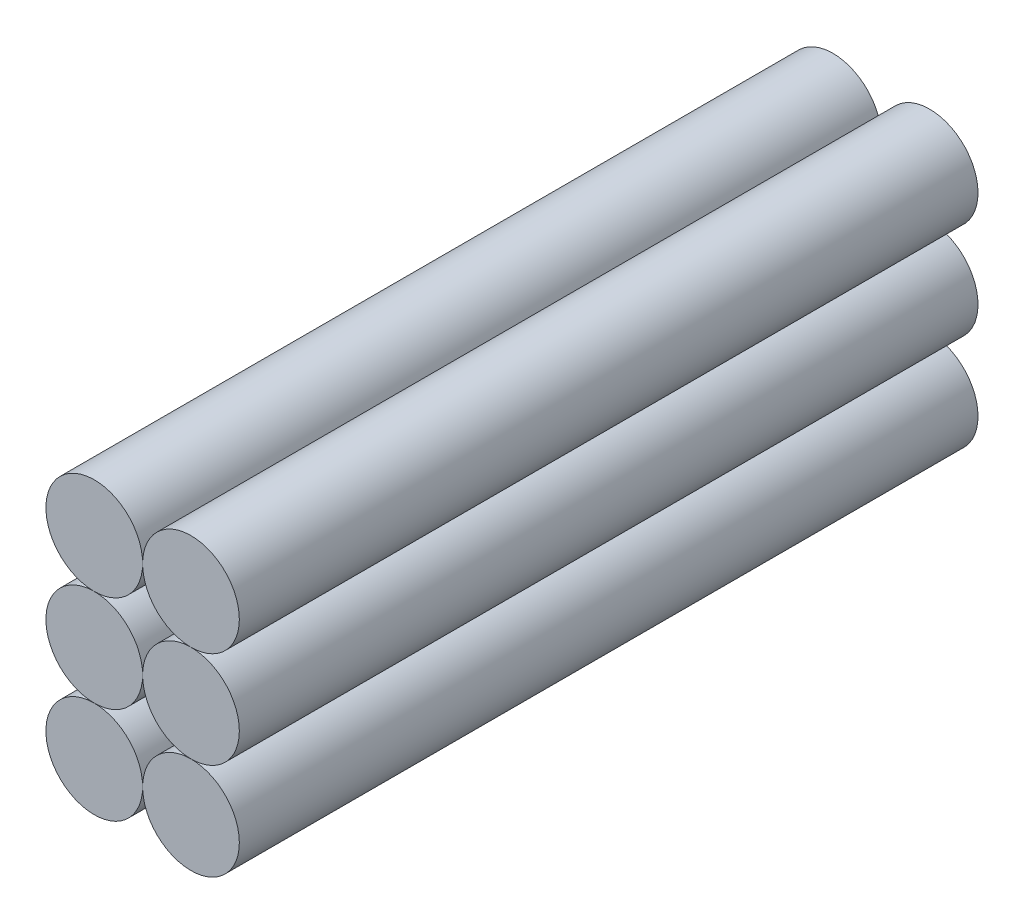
from build123d import *

# Parameters (mm, degrees)
SKETCH1_R             = 8.9789
BOSS_EXTRUDE1_DEPTH   = 68.58
BOSS_EXTRUDE1_2_DEPTH = 68.58
BOSS_EXTRUDE1_3_DEPTH = 68.58
BOSS_EXTRUDE1_4_DEPTH = 68.58
BOSS_EXTRUDE1_5_DEPTH = 68.58
BOSS_EXTRUDE1_6_DEPTH = 68.58


with BuildPart() as part:
    # Sketch1 → Boss-Extrude1 (new, symmetric)
    with BuildSketch(Plane.XY):
        with Locations((-8.9789, 17.9578)):
            Circle(SKETCH1_R)
    extrude(amount=BOSS_EXTRUDE1_DEPTH, both=True)


with BuildPart() as body_2:
    # Sketch1 → Boss-Extrude1 2 (new, symmetric)
    with BuildSketch(Plane.XY):
        with Locations((8.9789, 17.9578)):
            Circle(SKETCH1_R)
    extrude(amount=BOSS_EXTRUDE1_2_DEPTH, both=True)


with BuildPart() as body_3:
    # Sketch1 → Boss-Extrude1 3 (new, symmetric)
    with BuildSketch(Plane.XY):
        with Locations((8.9789, 0)):
            Circle(SKETCH1_R)
    extrude(amount=BOSS_EXTRUDE1_3_DEPTH, both=True)


with BuildPart() as body_4:
    # Sketch1 → Boss-Extrude1 4 (new, symmetric)
    with BuildSketch(Plane.XY):
        with Locations((-8.9789, 0)):
            Circle(SKETCH1_R)
    extrude(amount=BOSS_EXTRUDE1_4_DEPTH, both=True)


with BuildPart() as body_5:
    # Sketch1 → Boss-Extrude1 5 (new, symmetric)
    with BuildSketch(Plane.XY):
        with Locations((-8.9789, -17.9578)):
            Circle(SKETCH1_R)
    extrude(amount=BOSS_EXTRUDE1_5_DEPTH, both=True)


with BuildPart() as body_6:
    # Sketch1 → Boss-Extrude1 6 (new, symmetric)
    with BuildSketch(Plane.XY):
        with Locations((8.9789, -17.9578)):
            Circle(SKETCH1_R)
    extrude(amount=BOSS_EXTRUDE1_6_DEPTH, both=True)


solid = Compound([part.part, body_2.part, body_3.part, body_4.part, body_5.part, body_6.part])
